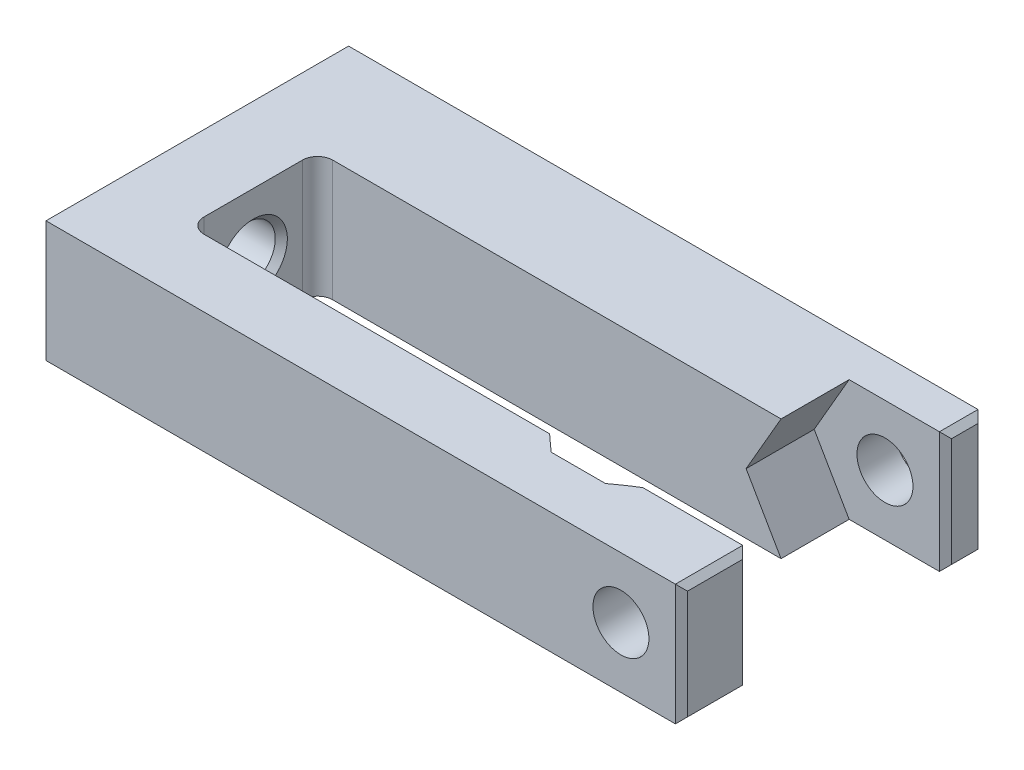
ISO-10303-21;
HEADER;
FILE_DESCRIPTION(('STEP AP214'),'2;1');
FILE_NAME('part.step','',(''),(''),'','','');
FILE_SCHEMA(('AUTOMOTIVE_DESIGN { 1 0 10303 214 1 1 1 1 }'));
ENDSEC;
DATA;
#1=APPLICATION_CONTEXT('core data for automotive mechanical design processes');
#2=APPLICATION_PROTOCOL_DEFINITION('international standard','automotive_design',2000,#1);
#3=PRODUCT_CONTEXT('',#1,'mechanical');
#4=PRODUCT('Part','Part','',(#3));
#5=PRODUCT_RELATED_PRODUCT_CATEGORY('part','',(#4));
#6=PRODUCT_DEFINITION_FORMATION('','',#4);
#7=PRODUCT_DEFINITION_CONTEXT('part definition',#1,'design');
#8=PRODUCT_DEFINITION('design','',#6,#7);
#9=PRODUCT_DEFINITION_SHAPE('','',#8);
#10=(LENGTH_UNIT() NAMED_UNIT(*) SI_UNIT(.MILLI.,.METRE.));
#11=(NAMED_UNIT(*) PLANE_ANGLE_UNIT() SI_UNIT($,.RADIAN.));
#12=(NAMED_UNIT(*) SI_UNIT($,.STERADIAN.) SOLID_ANGLE_UNIT());
#13=UNCERTAINTY_MEASURE_WITH_UNIT(LENGTH_MEASURE(1.E-05),#10,'distance_accuracy_value','');
#14=(GEOMETRIC_REPRESENTATION_CONTEXT(3) GLOBAL_UNCERTAINTY_ASSIGNED_CONTEXT((#13)) GLOBAL_UNIT_ASSIGNED_CONTEXT((#10,
#11,#12)) REPRESENTATION_CONTEXT('',''));
#15=CARTESIAN_POINT('',(0.,0.,0.));
#16=DIRECTION('',(0.,0.,1.));
#17=DIRECTION('',(1.,0.,0.));
#18=AXIS2_PLACEMENT_3D('',#15,#16,#17);
#19=CARTESIAN_POINT('',(42.,8.,-12.95));
#20=DIRECTION('',(-1.,0.,0.));
#21=DIRECTION('',(0.,0.,1.));
#22=AXIS2_PLACEMENT_3D('',#19,#20,#21);
#23=PLANE('',#22);
#24=DIRECTION('',(0.,1.,0.));
#25=VECTOR('',#24,1.);
#26=CARTESIAN_POINT('',(42.,8.,-19.6));
#27=LINE('',#26,#25);
#28=CARTESIAN_POINT('',(42.,0.399999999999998,-19.6));
#29=VERTEX_POINT('',#28);
#30=CARTESIAN_POINT('',(42.,7.6,-19.6));
#31=VERTEX_POINT('',#30);
#32=EDGE_CURVE('E490',#29,#31,#27,.T.);
#33=ORIENTED_EDGE('',*,*,#32,.T.);
#34=DIRECTION('',(0.,0.,1.));
#35=VECTOR('',#34,1.);
#36=CARTESIAN_POINT('',(42.,7.6,-17.45));
#37=LINE('',#36,#35);
#38=CARTESIAN_POINT('',(42.,7.6,-17.85));
#39=VERTEX_POINT('',#38);
#40=EDGE_CURVE('E492',#31,#39,#37,.T.);
#41=ORIENTED_EDGE('',*,*,#40,.T.);
#42=DIRECTION('',(0.,-1.,0.));
#43=VECTOR('',#42,1.);
#44=CARTESIAN_POINT('',(42.,0.,-17.85));
#45=LINE('',#44,#43);
#46=CARTESIAN_POINT('',(42.,0.399999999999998,-17.85));
#47=VERTEX_POINT('',#46);
#48=EDGE_CURVE('E486',#39,#47,#45,.T.);
#49=ORIENTED_EDGE('',*,*,#48,.T.);
#50=DIRECTION('',(0.,0.,-1.));
#51=VECTOR('',#50,1.);
#52=CARTESIAN_POINT('',(42.,0.399999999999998,-12.95));
#53=LINE('',#52,#51);
#54=EDGE_CURVE('E488',#47,#29,#53,.T.);
#55=ORIENTED_EDGE('',*,*,#54,.T.);
#56=EDGE_LOOP('',(#33,#41,#49,#55));
#57=FACE_BOUND('',#56,.T.);
#58=ADVANCED_FACE('F33',(#57),#23,.F.);
#59=CARTESIAN_POINT('',(38.,4.,-20.));
#60=DIRECTION('',(0.,0.,1.));
#61=DIRECTION('',(1.,0.,0.));
#62=AXIS2_PLACEMENT_3D('',#59,#60,#61);
#63=CYLINDRICAL_SURFACE('',#62,1.85);
#64=CARTESIAN_POINT('',(38.,4.,-20.));
#65=DIRECTION('',(0.,0.,1.));
#66=DIRECTION('',(1.,0.,0.));
#67=AXIS2_PLACEMENT_3D('',#64,#65,#66);
#68=CIRCLE('',#67,1.85);
#69=CARTESIAN_POINT('',(39.85,4.,-20.));
#70=VERTEX_POINT('',#69);
#71=EDGE_CURVE('E225',#70,#70,#68,.T.);
#72=ORIENTED_EDGE('',*,*,#71,.F.);
#73=EDGE_LOOP('',(#72));
#74=FACE_BOUND('',#73,.T.);
#75=CARTESIAN_POINT('',(38.,4.,-17.45));
#76=DIRECTION('',(0.,0.,1.));
#77=DIRECTION('',(1.,0.,0.));
#78=AXIS2_PLACEMENT_3D('',#75,#76,#77);
#79=CIRCLE('',#78,1.85);
#80=CARTESIAN_POINT('',(39.85,4.,-17.45));
#81=VERTEX_POINT('',#80);
#82=EDGE_CURVE('E187',#81,#81,#79,.F.);
#83=ORIENTED_EDGE('',*,*,#82,.F.);
#84=EDGE_LOOP('',(#83));
#85=FACE_BOUND('',#84,.T.);
#86=ADVANCED_FACE('F348',(#74,#85),#63,.F.);
#87=CARTESIAN_POINT('',(42.,8.,-4.45));
#88=DIRECTION('',(0.,0.,1.));
#89=DIRECTION('',(1.,0.,0.));
#90=AXIS2_PLACEMENT_3D('',#87,#88,#89);
#91=PLANE('',#90);
#92=DIRECTION('',(-1.,0.,0.));
#93=VECTOR('',#92,1.);
#94=CARTESIAN_POINT('',(42.,8.,-4.45));
#95=LINE('',#94,#93);
#96=CARTESIAN_POINT('',(28.8348486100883,8.,-4.45));
#97=VERTEX_POINT('',#96);
#98=CARTESIAN_POINT('',(6.,8.,-4.45));
#99=VERTEX_POINT('',#98);
#100=EDGE_CURVE('E241',#97,#99,#95,.T.);
#101=ORIENTED_EDGE('',*,*,#100,.F.);
#102=CARTESIAN_POINT('',(38.,4.,-4.45));
#103=DIRECTION('',(0.,0.,1.));
#104=DIRECTION('',(1.,0.,0.));
#105=AXIS2_PLACEMENT_3D('',#102,#103,#104);
#106=CIRCLE('',#105,10.);
#107=CARTESIAN_POINT('',(28.8348486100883,0.,-4.45));
#108=VERTEX_POINT('',#107);
#109=EDGE_CURVE('E307',#97,#108,#106,.T.);
#110=ORIENTED_EDGE('',*,*,#109,.T.);
#111=DIRECTION('',(-1.,0.,0.));
#112=VECTOR('',#111,1.);
#113=CARTESIAN_POINT('',(42.,0.,-4.45));
#114=LINE('',#113,#112);
#115=CARTESIAN_POINT('',(6.,0.,-4.45));
#116=VERTEX_POINT('',#115);
#117=EDGE_CURVE('E256',#108,#116,#114,.T.);
#118=ORIENTED_EDGE('',*,*,#117,.T.);
#119=DIRECTION('',(0.,-1.,0.));
#120=VECTOR('',#119,1.);
#121=CARTESIAN_POINT('',(6.,8.,-4.45));
#122=LINE('',#121,#120);
#123=EDGE_CURVE('E276',#116,#99,#122,.F.);
#124=ORIENTED_EDGE('',*,*,#123,.T.);
#125=EDGE_LOOP('',(#101,#110,#118,#124));
#126=FACE_BOUND('',#125,.T.);
#127=ADVANCED_FACE('F362',(#126),#91,.F.);
#128=CARTESIAN_POINT('',(0.,8.,-20.));
#129=DIRECTION('',(1.,0.,0.));
#130=DIRECTION('',(0.,0.,-1.));
#131=AXIS2_PLACEMENT_3D('',#128,#129,#130);
#132=PLANE('',#131);
#133=CARTESIAN_POINT('',(0.,3.99999999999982,-8.7));
#134=DIRECTION('',(-1.,0.,0.));
#135=DIRECTION('',(0.,0.,1.));
#136=AXIS2_PLACEMENT_3D('',#133,#134,#135);
#137=CIRCLE('',#136,1.85);
#138=CARTESIAN_POINT('',(0.,3.99999999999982,-6.85));
#139=VERTEX_POINT('',#138);
#140=EDGE_CURVE('E219',#139,#139,#137,.T.);
#141=ORIENTED_EDGE('',*,*,#140,.F.);
#142=EDGE_LOOP('',(#141));
#143=FACE_BOUND('',#142,.T.);
#144=DIRECTION('',(0.,0.,1.));
#145=VECTOR('',#144,1.);
#146=CARTESIAN_POINT('',(0.,0.,-20.));
#147=LINE('',#146,#145);
#148=CARTESIAN_POINT('',(0.,0.,-20.));
#149=VERTEX_POINT('',#148);
#150=CARTESIAN_POINT('',(0.,0.,0.));
#151=VERTEX_POINT('',#150);
#152=EDGE_CURVE('E233',#149,#151,#147,.T.);
#153=ORIENTED_EDGE('',*,*,#152,.T.);
#154=DIRECTION('',(0.,-1.,0.));
#155=VECTOR('',#154,1.);
#156=CARTESIAN_POINT('',(0.,8.,0.));
#157=LINE('',#156,#155);
#158=CARTESIAN_POINT('',(0.,8.,0.));
#159=VERTEX_POINT('',#158);
#160=EDGE_CURVE('E268',#159,#151,#157,.T.);
#161=ORIENTED_EDGE('',*,*,#160,.F.);
#162=DIRECTION('',(0.,0.,1.));
#163=VECTOR('',#162,1.);
#164=CARTESIAN_POINT('',(0.,8.,-20.));
#165=LINE('',#164,#163);
#166=CARTESIAN_POINT('',(0.,8.,-20.));
#167=VERTEX_POINT('',#166);
#168=EDGE_CURVE('E234',#167,#159,#165,.T.);
#169=ORIENTED_EDGE('',*,*,#168,.F.);
#170=DIRECTION('',(0.,-1.,0.));
#171=VECTOR('',#170,1.);
#172=CARTESIAN_POINT('',(0.,8.,-20.));
#173=LINE('',#172,#171);
#174=EDGE_CURVE('E250',#167,#149,#173,.T.);
#175=ORIENTED_EDGE('',*,*,#174,.T.);
#176=EDGE_LOOP('',(#153,#161,#169,#175));
#177=FACE_BOUND('',#176,.T.);
#178=ADVANCED_FACE('F369',(#143,#177),#132,.F.);
#179=CARTESIAN_POINT('',(0.,8.,0.));
#180=DIRECTION('',(0.,0.,-1.));
#181=DIRECTION('',(-1.,0.,0.));
#182=AXIS2_PLACEMENT_3D('',#179,#180,#181);
#183=PLANE('',#182);
#184=CARTESIAN_POINT('',(38.,4.,0.));
#185=DIRECTION('',(0.,0.,1.));
#186=DIRECTION('',(1.,0.,0.));
#187=AXIS2_PLACEMENT_3D('',#184,#185,#186);
#188=CIRCLE('',#187,1.85);
#189=CARTESIAN_POINT('',(39.85,4.,0.));
#190=VERTEX_POINT('',#189);
#191=EDGE_CURVE('E224',#190,#190,#188,.T.);
#192=ORIENTED_EDGE('',*,*,#191,.F.);
#193=EDGE_LOOP('',(#192));
#194=FACE_BOUND('',#193,.T.);
#195=DIRECTION('',(1.,0.,0.));
#196=VECTOR('',#195,1.);
#197=CARTESIAN_POINT('',(0.,0.,0.));
#198=LINE('',#197,#196);
#199=CARTESIAN_POINT('',(41.6,0.,0.));
#200=VERTEX_POINT('',#199);
#201=EDGE_CURVE('E253',#151,#200,#198,.T.);
#202=ORIENTED_EDGE('',*,*,#201,.T.);
#203=DIRECTION('',(0.,1.,0.));
#204=VECTOR('',#203,1.);
#205=CARTESIAN_POINT('',(41.6,8.,0.));
#206=LINE('',#205,#204);
#207=CARTESIAN_POINT('',(41.6,8.,0.));
#208=VERTEX_POINT('',#207);
#209=EDGE_CURVE('E471',#200,#208,#206,.T.);
#210=ORIENTED_EDGE('',*,*,#209,.T.);
#211=DIRECTION('',(1.,0.,0.));
#212=VECTOR('',#211,1.);
#213=CARTESIAN_POINT('',(0.,8.,0.));
#214=LINE('',#213,#212);
#215=EDGE_CURVE('E237',#159,#208,#214,.T.);
#216=ORIENTED_EDGE('',*,*,#215,.F.);
#217=ORIENTED_EDGE('',*,*,#160,.T.);
#218=EDGE_LOOP('',(#202,#210,#216,#217));
#219=FACE_BOUND('',#218,.T.);
#220=ADVANCED_FACE('F365',(#194,#219),#183,.F.);
#221=CARTESIAN_POINT('',(42.,8.,0.));
#222=DIRECTION('',(-1.,0.,0.));
#223=DIRECTION('',(0.,0.,1.));
#224=AXIS2_PLACEMENT_3D('',#221,#222,#223);
#225=PLANE('',#224);
#226=DIRECTION('',(0.,0.,1.));
#227=VECTOR('',#226,1.);
#228=CARTESIAN_POINT('',(42.,7.6,0.));
#229=LINE('',#228,#227);
#230=CARTESIAN_POINT('',(42.,7.6,-4.05));
#231=VERTEX_POINT('',#230);
#232=CARTESIAN_POINT('',(42.,7.6,-0.399999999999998));
#233=VERTEX_POINT('',#232);
#234=EDGE_CURVE('E464',#231,#233,#229,.T.);
#235=ORIENTED_EDGE('',*,*,#234,.T.);
#236=DIRECTION('',(0.,-1.,0.));
#237=VECTOR('',#236,1.);
#238=CARTESIAN_POINT('',(42.,8.,-0.399999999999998));
#239=LINE('',#238,#237);
#240=CARTESIAN_POINT('',(42.,0.399999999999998,-0.399999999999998));
#241=VERTEX_POINT('',#240);
#242=EDGE_CURVE('E468',#233,#241,#239,.T.);
#243=ORIENTED_EDGE('',*,*,#242,.T.);
#244=DIRECTION('',(0.,0.,-1.));
#245=VECTOR('',#244,1.);
#246=CARTESIAN_POINT('',(42.,0.399999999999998,0.));
#247=LINE('',#246,#245);
#248=CARTESIAN_POINT('',(42.,0.399999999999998,-4.05));
#249=VERTEX_POINT('',#248);
#250=EDGE_CURVE('E473',#241,#249,#247,.T.);
#251=ORIENTED_EDGE('',*,*,#250,.T.);
#252=DIRECTION('',(0.,1.,0.));
#253=VECTOR('',#252,1.);
#254=CARTESIAN_POINT('',(42.,8.,-4.05));
#255=LINE('',#254,#253);
#256=EDGE_CURVE('E469',#249,#231,#255,.T.);
#257=ORIENTED_EDGE('',*,*,#256,.T.);
#258=EDGE_LOOP('',(#235,#243,#251,#257));
#259=FACE_BOUND('',#258,.T.);
#260=ADVANCED_FACE('F360',(#259),#225,.F.);
#261=CARTESIAN_POINT('',(38.,4.,-4.45));
#262=DIRECTION('',(0.,0.,1.));
#263=DIRECTION('',(1.,0.,0.));
#264=AXIS2_PLACEMENT_3D('',#261,#262,#263);
#265=CIRCLE('',#264,1.85);
#266=CARTESIAN_POINT('',(39.85,4.,-4.45));
#267=VERTEX_POINT('',#266);
#268=EDGE_CURVE('E228',#267,#267,#265,.T.);
#269=ORIENTED_EDGE('',*,*,#268,.T.);
#270=EDGE_LOOP('',(#269));
#271=FACE_BOUND('',#270,.T.);
#272=CARTESIAN_POINT('',(41.6,8.,-4.45));
#273=VERTEX_POINT('',#272);
#274=CARTESIAN_POINT('',(35.,8.,-4.45));
#275=VERTEX_POINT('',#274);
#276=EDGE_CURVE('E242',#273,#275,#95,.T.);
#277=ORIENTED_EDGE('',*,*,#276,.F.);
#278=DIRECTION('',(0.,-1.,0.));
#279=VECTOR('',#278,1.);
#280=CARTESIAN_POINT('',(41.6,8.,-4.45));
#281=LINE('',#280,#279);
#282=CARTESIAN_POINT('',(41.6,0.,-4.45));
#283=VERTEX_POINT('',#282);
#284=EDGE_CURVE('E445',#273,#283,#281,.T.);
#285=ORIENTED_EDGE('',*,*,#284,.T.);
#286=CARTESIAN_POINT('',(35.,0.,-4.45));
#287=VERTEX_POINT('',#286);
#288=EDGE_CURVE('E257',#283,#287,#114,.T.);
#289=ORIENTED_EDGE('',*,*,#288,.T.);
#290=CARTESIAN_POINT('',(38.,4.,-4.45));
#291=DIRECTION('',(0.,0.,1.));
#292=DIRECTION('',(1.,0.,0.));
#293=AXIS2_PLACEMENT_3D('',#290,#291,#292);
#294=CIRCLE('',#293,5.);
#295=EDGE_CURVE('E213',#275,#287,#294,.T.);
#296=ORIENTED_EDGE('',*,*,#295,.F.);
#297=EDGE_LOOP('',(#277,#285,#289,#296));
#298=FACE_BOUND('',#297,.T.);
#299=ADVANCED_FACE('F356',(#271,#298),#91,.F.);
#300=CARTESIAN_POINT('',(5.,8.,-4.45));
#301=DIRECTION('',(-1.,0.,0.));
#302=DIRECTION('',(0.,0.,1.));
#303=AXIS2_PLACEMENT_3D('',#300,#301,#302);
#304=PLANE('',#303);
#305=CARTESIAN_POINT('',(5.,3.99999999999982,-8.7));
#306=DIRECTION('',(-1.,0.,0.));
#307=DIRECTION('',(0.,0.,1.));
#308=AXIS2_PLACEMENT_3D('',#305,#306,#307);
#309=CIRCLE('',#308,2.24999999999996);
#310=CARTESIAN_POINT('',(5.,3.99999999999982,-6.45000000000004));
#311=VERTEX_POINT('',#310);
#312=EDGE_CURVE('E291',#311,#311,#309,.T.);
#313=ORIENTED_EDGE('',*,*,#312,.T.);
#314=EDGE_LOOP('',(#313));
#315=FACE_BOUND('',#314,.T.);
#316=DIRECTION('',(0.,0.,-1.));
#317=VECTOR('',#316,1.);
#318=CARTESIAN_POINT('',(5.,8.,-4.45));
#319=LINE('',#318,#317);
#320=CARTESIAN_POINT('',(5.,8.,-5.45));
#321=VERTEX_POINT('',#320);
#322=CARTESIAN_POINT('',(5.,8.,-11.95));
#323=VERTEX_POINT('',#322);
#324=EDGE_CURVE('E244',#321,#323,#319,.T.);
#325=ORIENTED_EDGE('',*,*,#324,.F.);
#326=DIRECTION('',(0.,-1.,0.));
#327=VECTOR('',#326,1.);
#328=CARTESIAN_POINT('',(5.,0.,-5.45));
#329=LINE('',#328,#327);
#330=CARTESIAN_POINT('',(5.,0.,-5.45));
#331=VERTEX_POINT('',#330);
#332=EDGE_CURVE('E273',#321,#331,#329,.T.);
#333=ORIENTED_EDGE('',*,*,#332,.T.);
#334=DIRECTION('',(0.,0.,-1.));
#335=VECTOR('',#334,1.);
#336=CARTESIAN_POINT('',(5.,0.,-4.45));
#337=LINE('',#336,#335);
#338=CARTESIAN_POINT('',(5.,0.,-11.95));
#339=VERTEX_POINT('',#338);
#340=EDGE_CURVE('E259',#331,#339,#337,.T.);
#341=ORIENTED_EDGE('',*,*,#340,.T.);
#342=DIRECTION('',(0.,-1.,0.));
#343=VECTOR('',#342,1.);
#344=CARTESIAN_POINT('',(5.,8.,-11.95));
#345=LINE('',#344,#343);
#346=EDGE_CURVE('E271',#339,#323,#345,.F.);
#347=ORIENTED_EDGE('',*,*,#346,.T.);
#348=EDGE_LOOP('',(#325,#333,#341,#347));
#349=FACE_BOUND('',#348,.T.);
#350=ADVANCED_FACE('F352',(#315,#349),#304,.F.);
#351=CARTESIAN_POINT('',(5.,8.,-12.95));
#352=DIRECTION('',(0.,0.,-1.));
#353=DIRECTION('',(-1.,0.,0.));
#354=AXIS2_PLACEMENT_3D('',#351,#352,#353);
#355=PLANE('',#354);
#356=DIRECTION('',(1.,0.,0.));
#357=VECTOR('',#356,1.);
#358=CARTESIAN_POINT('',(5.,0.,-12.95));
#359=LINE('',#358,#357);
#360=CARTESIAN_POINT('',(6.,0.,-12.95));
#361=VERTEX_POINT('',#360);
#362=CARTESIAN_POINT('',(35.6328638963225,0.,-12.95));
#363=VERTEX_POINT('',#362);
#364=EDGE_CURVE('E262',#361,#363,#359,.T.);
#365=ORIENTED_EDGE('',*,*,#364,.T.);
#366=DIRECTION('',(0.500000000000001,-0.866025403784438,0.));
#367=VECTOR('',#366,1.);
#368=CARTESIAN_POINT('',(26.7246479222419,15.4294826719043,-12.95));
#369=LINE('',#368,#367);
#370=CARTESIAN_POINT('',(33.323462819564,4.00000000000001,-12.95));
#371=VERTEX_POINT('',#370);
#372=EDGE_CURVE('E408',#371,#363,#369,.T.);
#373=ORIENTED_EDGE('',*,*,#372,.F.);
#374=DIRECTION('',(-0.5,-0.866025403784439,0.));
#375=VECTOR('',#374,1.);
#376=CARTESIAN_POINT('',(23.2605463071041,-13.4294826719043,-12.95));
#377=LINE('',#376,#375);
#378=CARTESIAN_POINT('',(35.6328638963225,8.,-12.95));
#379=VERTEX_POINT('',#378);
#380=EDGE_CURVE('E407',#379,#371,#377,.T.);
#381=ORIENTED_EDGE('',*,*,#380,.F.);
#382=DIRECTION('',(1.,0.,0.));
#383=VECTOR('',#382,1.);
#384=CARTESIAN_POINT('',(5.,8.,-12.95));
#385=LINE('',#384,#383);
#386=CARTESIAN_POINT('',(6.,8.,-12.95));
#387=VERTEX_POINT('',#386);
#388=EDGE_CURVE('E201',#387,#379,#385,.T.);
#389=ORIENTED_EDGE('',*,*,#388,.F.);
#390=DIRECTION('',(0.,-1.,0.));
#391=VECTOR('',#390,1.);
#392=CARTESIAN_POINT('',(6.,0.,-12.95));
#393=LINE('',#392,#391);
#394=EDGE_CURVE('E279',#387,#361,#393,.T.);
#395=ORIENTED_EDGE('',*,*,#394,.T.);
#396=EDGE_LOOP('',(#365,#373,#381,#389,#395));
#397=FACE_BOUND('',#396,.T.);
#398=ADVANCED_FACE('F344',(#397),#355,.F.);
#399=CARTESIAN_POINT('',(42.,8.,-20.));
#400=DIRECTION('',(0.,0.,1.));
#401=DIRECTION('',(1.,0.,0.));
#402=AXIS2_PLACEMENT_3D('',#399,#400,#401);
#403=PLANE('',#402);
#404=ORIENTED_EDGE('',*,*,#71,.T.);
#405=EDGE_LOOP('',(#404));
#406=FACE_BOUND('',#405,.T.);
#407=DIRECTION('',(-1.,0.,0.));
#408=VECTOR('',#407,1.);
#409=CARTESIAN_POINT('',(42.,8.,-20.));
#410=LINE('',#409,#408);
#411=CARTESIAN_POINT('',(41.6,8.,-20.));
#412=VERTEX_POINT('',#411);
#413=EDGE_CURVE('E248',#412,#167,#410,.T.);
#414=ORIENTED_EDGE('',*,*,#413,.F.);
#415=DIRECTION('',(0.,-1.,0.));
#416=VECTOR('',#415,1.);
#417=CARTESIAN_POINT('',(41.6,8.,-20.));
#418=LINE('',#417,#416);
#419=CARTESIAN_POINT('',(41.6,0.,-20.));
#420=VERTEX_POINT('',#419);
#421=EDGE_CURVE('E57',#412,#420,#418,.T.);
#422=ORIENTED_EDGE('',*,*,#421,.T.);
#423=DIRECTION('',(-1.,0.,0.));
#424=VECTOR('',#423,1.);
#425=CARTESIAN_POINT('',(42.,0.,-20.));
#426=LINE('',#425,#424);
#427=EDGE_CURVE('E238',#420,#149,#426,.T.);
#428=ORIENTED_EDGE('',*,*,#427,.T.);
#429=ORIENTED_EDGE('',*,*,#174,.F.);
#430=EDGE_LOOP('',(#414,#422,#428,#429));
#431=FACE_BOUND('',#430,.T.);
#432=ADVANCED_FACE('F340',(#406,#431),#403,.F.);
#433=CARTESIAN_POINT('',(0.,8.,0.));
#434=DIRECTION('',(0.,1.,0.));
#435=DIRECTION('',(0.,0.,1.));
#436=AXIS2_PLACEMENT_3D('',#433,#434,#435);
#437=PLANE('',#436);
#438=DIRECTION('',(-1.,0.,0.));
#439=VECTOR('',#438,1.);
#440=CARTESIAN_POINT('',(0.,8.,-17.45));
#441=LINE('',#440,#439);
#442=CARTESIAN_POINT('',(41.6,8.,-17.45));
#443=VERTEX_POINT('',#442);
#444=CARTESIAN_POINT('',(35.6328638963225,8.,-17.45));
#445=VERTEX_POINT('',#444);
#446=EDGE_CURVE('E178',#443,#445,#441,.T.);
#447=ORIENTED_EDGE('',*,*,#446,.F.);
#448=DIRECTION('',(0.,0.,-1.));
#449=VECTOR('',#448,1.);
#450=CARTESIAN_POINT('',(41.6,8.,-20.));
#451=LINE('',#450,#449);
#452=EDGE_CURVE('E480',#443,#412,#451,.T.);
#453=ORIENTED_EDGE('',*,*,#452,.T.);
#454=ORIENTED_EDGE('',*,*,#413,.T.);
#455=ORIENTED_EDGE('',*,*,#168,.T.);
#456=ORIENTED_EDGE('',*,*,#215,.T.);
#457=DIRECTION('',(0.,0.,-1.));
#458=VECTOR('',#457,1.);
#459=CARTESIAN_POINT('',(41.6,8.,-4.45));
#460=LINE('',#459,#458);
#461=EDGE_CURVE('E457',#208,#273,#460,.T.);
#462=ORIENTED_EDGE('',*,*,#461,.T.);
#463=ORIENTED_EDGE('',*,*,#276,.T.);
#464=CARTESIAN_POINT('',(35.,8.,-4.44999999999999));
#465=CARTESIAN_POINT('',(34.8727311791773,8.,-4.37359864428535));
#466=CARTESIAN_POINT('',(34.7468222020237,8.,-4.29498407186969));
#467=CARTESIAN_POINT('',(34.4974561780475,8.,-4.13411459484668));
#468=CARTESIAN_POINT('',(34.3739976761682,8.,-4.05186195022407));
#469=CARTESIAN_POINT('',(34.1291302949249,8.,-3.88442106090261));
#470=CARTESIAN_POINT('',(34.0077210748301,8.,-3.79923331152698));
#471=CARTESIAN_POINT('',(33.7665819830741,8.,-3.62635645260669));
#472=CARTESIAN_POINT('',(33.6468531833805,8.,-3.53866584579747));
#473=CARTESIAN_POINT('',(33.5278640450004,8.,-3.45));
#474=B_SPLINE_CURVE_WITH_KNOTS('',3,(#464,#465,#466,#467,#468,#469,#470,#471,#472,#473),
.UNSPECIFIED.,.F.,.F.,(4,2,2,2,4),(0.,0.445259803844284,0.890246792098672,1.33515904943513,
1.78034328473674),.UNSPECIFIED.);
#475=CARTESIAN_POINT('',(33.5278640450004,8.,-3.45));
#476=VERTEX_POINT('',#475);
#477=EDGE_CURVE('E530',#275,#476,#474,.T.);
#478=ORIENTED_EDGE('',*,*,#477,.T.);
#479=DIRECTION('',(1.,0.,0.));
#480=VECTOR('',#479,1.);
#481=CARTESIAN_POINT('',(35.,8.,-3.45));
#482=LINE('',#481,#480);
#483=CARTESIAN_POINT('',(29.9377422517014,8.,-3.45));
#484=VERTEX_POINT('',#483);
#485=EDGE_CURVE('E216',#484,#476,#482,.T.);
#486=ORIENTED_EDGE('',*,*,#485,.F.);
#487=CARTESIAN_POINT('',(29.9377422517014,8.,-3.45));
#488=CARTESIAN_POINT('',(29.8453344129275,8.,-3.53278046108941));
#489=CARTESIAN_POINT('',(29.7530654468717,8.,-3.61571577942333));
#490=CARTESIAN_POINT('',(29.5687846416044,8.,-3.78187012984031));
#491=CARTESIAN_POINT('',(29.4767728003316,8.,-3.86508915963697));
#492=CARTESIAN_POINT('',(29.2929842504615,8.,-4.03178616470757));
#493=CARTESIAN_POINT('',(29.2012075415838,8.,-4.11526413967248));
#494=CARTESIAN_POINT('',(29.0178702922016,8.,-4.28245862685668));
#495=CARTESIAN_POINT('',(28.9263097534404,8.,-4.36617514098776));
#496=CARTESIAN_POINT('',(28.8348486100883,8.,-4.45));
#497=B_SPLINE_CURVE_WITH_KNOTS('',3,(#487,#488,#489,#490,#491,#492,#493,#494,#495,#496),
.UNSPECIFIED.,.F.,.F.,(4,2,2,2,4),(0.,0.372190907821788,0.744378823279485,1.11656629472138,
1.48875675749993),.UNSPECIFIED.);
#498=EDGE_CURVE('E300',#484,#97,#497,.T.);
#499=ORIENTED_EDGE('',*,*,#498,.T.);
#500=ORIENTED_EDGE('',*,*,#100,.T.);
#501=CARTESIAN_POINT('',(6.,8.,-5.45));
#502=DIRECTION('',(0.,1.,0.));
#503=DIRECTION('',(0.,0.,1.));
#504=AXIS2_PLACEMENT_3D('',#501,#502,#503);
#505=CIRCLE('',#504,1.);
#506=EDGE_CURVE('E285',#99,#321,#505,.F.);
#507=ORIENTED_EDGE('',*,*,#506,.T.);
#508=ORIENTED_EDGE('',*,*,#324,.T.);
#509=CARTESIAN_POINT('',(6.,8.,-11.95));
#510=DIRECTION('',(0.,1.,0.));
#511=DIRECTION('',(0.,0.,1.));
#512=AXIS2_PLACEMENT_3D('',#509,#510,#511);
#513=CIRCLE('',#512,1.);
#514=EDGE_CURVE('E289',#323,#387,#513,.F.);
#515=ORIENTED_EDGE('',*,*,#514,.T.);
#516=ORIENTED_EDGE('',*,*,#388,.T.);
#517=DIRECTION('',(0.,0.,1.));
#518=VECTOR('',#517,1.);
#519=CARTESIAN_POINT('',(35.6328638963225,8.,-17.45));
#520=LINE('',#519,#518);
#521=EDGE_CURVE('E192',#445,#379,#520,.T.);
#522=ORIENTED_EDGE('',*,*,#521,.F.);
#523=EDGE_LOOP('',(#447,#453,#454,#455,#456,#462,#463,#478,#486,#499,#500,#507,#508,#515,#516,#522));
#524=FACE_BOUND('',#523,.T.);
#525=ADVANCED_FACE('F199',(#524),#437,.T.);
#526=CARTESIAN_POINT('',(0.,0.,0.));
#527=DIRECTION('',(0.,1.,0.));
#528=DIRECTION('',(0.,0.,1.));
#529=AXIS2_PLACEMENT_3D('',#526,#527,#528);
#530=PLANE('',#529);
#531=ORIENTED_EDGE('',*,*,#427,.F.);
#532=DIRECTION('',(0.,0.,1.));
#533=VECTOR('',#532,1.);
#534=CARTESIAN_POINT('',(41.6,0.,0.));
#535=LINE('',#534,#533);
#536=CARTESIAN_POINT('',(41.6,0.,-17.45));
#537=VERTEX_POINT('',#536);
#538=EDGE_CURVE('E42',#420,#537,#535,.T.);
#539=ORIENTED_EDGE('',*,*,#538,.T.);
#540=DIRECTION('',(1.,0.,0.));
#541=VECTOR('',#540,1.);
#542=CARTESIAN_POINT('',(0.,0.,-17.45));
#543=LINE('',#542,#541);
#544=CARTESIAN_POINT('',(35.6328638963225,0.,-17.45));
#545=VERTEX_POINT('',#544);
#546=EDGE_CURVE('E202',#545,#537,#543,.T.);
#547=ORIENTED_EDGE('',*,*,#546,.F.);
#548=DIRECTION('',(0.,0.,1.));
#549=VECTOR('',#548,1.);
#550=CARTESIAN_POINT('',(35.6328638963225,0.,-17.45));
#551=LINE('',#550,#549);
#552=EDGE_CURVE('E204',#545,#363,#551,.T.);
#553=ORIENTED_EDGE('',*,*,#552,.T.);
#554=ORIENTED_EDGE('',*,*,#364,.F.);
#555=CARTESIAN_POINT('',(6.,0.,-11.95));
#556=DIRECTION('',(0.,1.,0.));
#557=DIRECTION('',(0.,0.,1.));
#558=AXIS2_PLACEMENT_3D('',#555,#556,#557);
#559=CIRCLE('',#558,1.);
#560=EDGE_CURVE('E287',#361,#339,#559,.T.);
#561=ORIENTED_EDGE('',*,*,#560,.T.);
#562=ORIENTED_EDGE('',*,*,#340,.F.);
#563=CARTESIAN_POINT('',(6.,0.,-5.45));
#564=DIRECTION('',(0.,1.,0.));
#565=DIRECTION('',(0.,0.,1.));
#566=AXIS2_PLACEMENT_3D('',#563,#564,#565);
#567=CIRCLE('',#566,1.);
#568=EDGE_CURVE('E282',#331,#116,#567,.T.);
#569=ORIENTED_EDGE('',*,*,#568,.T.);
#570=ORIENTED_EDGE('',*,*,#117,.F.);
#571=CARTESIAN_POINT('',(28.8348486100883,0.,-4.45));
#572=CARTESIAN_POINT('',(28.9263097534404,0.,-4.36617514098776));
#573=CARTESIAN_POINT('',(29.0178702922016,0.,-4.28245862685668));
#574=CARTESIAN_POINT('',(29.2012075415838,0.,-4.11526413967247));
#575=CARTESIAN_POINT('',(29.2929842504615,0.,-4.03178616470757));
#576=CARTESIAN_POINT('',(29.4767728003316,0.,-3.86508915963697));
#577=CARTESIAN_POINT('',(29.5687846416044,0.,-3.7818701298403));
#578=CARTESIAN_POINT('',(29.7530654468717,0.,-3.61571577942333));
#579=CARTESIAN_POINT('',(29.8453344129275,0.,-3.53278046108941));
#580=CARTESIAN_POINT('',(29.9377422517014,0.,-3.45));
#581=B_SPLINE_CURVE_WITH_KNOTS('',3,(#571,#572,#573,#574,#575,#576,#577,#578,#579,#580),
.UNSPECIFIED.,.F.,.F.,(4,2,2,2,4),(0.,0.372190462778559,0.74437793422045,1.11656584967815,
1.48875675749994),.UNSPECIFIED.);
#582=CARTESIAN_POINT('',(29.9377422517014,0.,-3.45));
#583=VERTEX_POINT('',#582);
#584=EDGE_CURVE('E325',#108,#583,#581,.T.);
#585=ORIENTED_EDGE('',*,*,#584,.T.);
#586=DIRECTION('',(-1.,0.,0.));
#587=VECTOR('',#586,1.);
#588=CARTESIAN_POINT('',(29.9377422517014,0.,-3.45));
#589=LINE('',#588,#587);
#590=CARTESIAN_POINT('',(33.5278640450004,0.,-3.45));
#591=VERTEX_POINT('',#590);
#592=EDGE_CURVE('E209',#591,#583,#589,.T.);
#593=ORIENTED_EDGE('',*,*,#592,.F.);
#594=CARTESIAN_POINT('',(33.5278640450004,0.,-3.45));
#595=CARTESIAN_POINT('',(33.6468531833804,0.,-3.53866584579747));
#596=CARTESIAN_POINT('',(33.7665819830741,0.,-3.62635645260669));
#597=CARTESIAN_POINT('',(34.0077210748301,0.,-3.79923331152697));
#598=CARTESIAN_POINT('',(34.1291302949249,0.,-3.88442106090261));
#599=CARTESIAN_POINT('',(34.3739976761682,0.,-4.05186195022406));
#600=CARTESIAN_POINT('',(34.4974561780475,0.,-4.13411459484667));
#601=CARTESIAN_POINT('',(34.7468222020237,0.,-4.29498407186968));
#602=CARTESIAN_POINT('',(34.8727311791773,0.,-4.37359864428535));
#603=CARTESIAN_POINT('',(35.,0.,-4.44999999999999));
#604=B_SPLINE_CURVE_WITH_KNOTS('',3,(#594,#595,#596,#597,#598,#599,#600,#601,#602,#603),
.UNSPECIFIED.,.F.,.F.,(4,2,2,2,4),(0.,0.445184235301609,0.890096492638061,1.33508348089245,
1.78034328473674),.UNSPECIFIED.);
#605=EDGE_CURVE('E330',#591,#287,#604,.T.);
#606=ORIENTED_EDGE('',*,*,#605,.T.);
#607=ORIENTED_EDGE('',*,*,#288,.F.);
#608=DIRECTION('',(0.,0.,1.));
#609=VECTOR('',#608,1.);
#610=CARTESIAN_POINT('',(41.6,0.,0.));
#611=LINE('',#610,#609);
#612=EDGE_CURVE('E456',#283,#200,#611,.T.);
#613=ORIENTED_EDGE('',*,*,#612,.T.);
#614=ORIENTED_EDGE('',*,*,#201,.F.);
#615=ORIENTED_EDGE('',*,*,#152,.F.);
#616=EDGE_LOOP('',(#531,#539,#547,#553,#554,#561,#562,#569,#570,#585,#593,#606,#607,#613,#614,#615));
#617=FACE_BOUND('',#616,.T.);
#618=ADVANCED_FACE('F335',(#617),#530,.F.);
#619=ORIENTED_EDGE('',*,*,#191,.T.);
#620=EDGE_LOOP('',(#619));
#621=FACE_BOUND('',#620,.T.);
#622=ORIENTED_EDGE('',*,*,#268,.F.);
#623=EDGE_LOOP('',(#622));
#624=FACE_BOUND('',#623,.T.);
#625=ADVANCED_FACE('F339',(#621,#624),#63,.F.);
#626=CARTESIAN_POINT('',(42.,3.99999999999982,-8.7));
#627=DIRECTION('',(-1.,0.,0.));
#628=DIRECTION('',(0.,0.,1.));
#629=AXIS2_PLACEMENT_3D('',#626,#627,#628);
#630=CYLINDRICAL_SURFACE('',#629,1.85);
#631=CARTESIAN_POINT('',(4.60000000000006,3.99999999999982,-8.7));
#632=DIRECTION('',(-1.,0.,0.));
#633=DIRECTION('',(0.,0.,1.));
#634=AXIS2_PLACEMENT_3D('',#631,#632,#633);
#635=CIRCLE('',#634,1.85);
#636=CARTESIAN_POINT('',(4.60000000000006,3.99999999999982,-6.85));
#637=VERTEX_POINT('',#636);
#638=EDGE_CURVE('E294',#637,#637,#635,.F.);
#639=CARTESIAN_POINT('',(4.60000000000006,3.99999999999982,-6.85));
#640=CARTESIAN_POINT('',(4.55208333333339,3.99999999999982,-6.85));
#641=CARTESIAN_POINT('',(4.50416666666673,3.99999999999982,-6.85));
#642=CARTESIAN_POINT('',(4.40833333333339,3.99999999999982,-6.85));
#643=CARTESIAN_POINT('',(4.36041666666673,3.99999999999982,-6.85));
#644=CARTESIAN_POINT('',(4.26458333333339,3.99999999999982,-6.85));
#645=CARTESIAN_POINT('',(4.21666666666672,3.99999999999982,-6.85));
#646=CARTESIAN_POINT('',(4.12083333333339,3.99999999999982,-6.85));
#647=CARTESIAN_POINT('',(4.07291666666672,3.99999999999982,-6.85));
#648=CARTESIAN_POINT('',(3.97708333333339,3.99999999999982,-6.85));
#649=CARTESIAN_POINT('',(3.92916666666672,3.99999999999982,-6.85));
#650=CARTESIAN_POINT('',(3.83333333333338,3.99999999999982,-6.85));
#651=CARTESIAN_POINT('',(3.78541666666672,3.99999999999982,-6.85));
#652=CARTESIAN_POINT('',(3.68958333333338,3.99999999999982,-6.85));
#653=CARTESIAN_POINT('',(3.64166666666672,3.99999999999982,-6.85));
#654=CARTESIAN_POINT('',(3.54583333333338,3.99999999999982,-6.85));
#655=CARTESIAN_POINT('',(3.49791666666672,3.99999999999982,-6.85));
#656=CARTESIAN_POINT('',(3.40208333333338,3.99999999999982,-6.85));
#657=CARTESIAN_POINT('',(3.35416666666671,3.99999999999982,-6.85));
#658=CARTESIAN_POINT('',(3.25833333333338,3.99999999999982,-6.85));
#659=CARTESIAN_POINT('',(3.21041666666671,3.99999999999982,-6.85));
#660=CARTESIAN_POINT('',(3.11458333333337,3.99999999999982,-6.85));
#661=CARTESIAN_POINT('',(3.06666666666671,3.99999999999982,-6.85));
#662=CARTESIAN_POINT('',(2.97083333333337,3.99999999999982,-6.85));
#663=CARTESIAN_POINT('',(2.92291666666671,3.99999999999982,-6.85));
#664=CARTESIAN_POINT('',(2.82708333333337,3.99999999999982,-6.85));
#665=CARTESIAN_POINT('',(2.77916666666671,3.99999999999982,-6.85));
#666=CARTESIAN_POINT('',(2.68333333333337,3.99999999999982,-6.85));
#667=CARTESIAN_POINT('',(2.6354166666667,3.99999999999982,-6.85));
#668=CARTESIAN_POINT('',(2.53958333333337,3.99999999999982,-6.85));
#669=CARTESIAN_POINT('',(2.4916666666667,3.99999999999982,-6.85));
#670=CARTESIAN_POINT('',(2.39583333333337,3.99999999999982,-6.85));
#671=CARTESIAN_POINT('',(2.3479166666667,3.99999999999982,-6.85));
#672=CARTESIAN_POINT('',(2.25208333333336,3.99999999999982,-6.85));
#673=CARTESIAN_POINT('',(2.20416666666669,3.99999999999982,-6.85));
#674=CARTESIAN_POINT('',(2.10833333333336,3.99999999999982,-6.85));
#675=CARTESIAN_POINT('',(2.06041666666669,3.99999999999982,-6.85));
#676=CARTESIAN_POINT('',(1.96458333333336,3.99999999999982,-6.85));
#677=CARTESIAN_POINT('',(1.91666666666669,3.99999999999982,-6.85));
#678=CARTESIAN_POINT('',(1.82083333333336,3.99999999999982,-6.85));
#679=CARTESIAN_POINT('',(1.77291666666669,3.99999999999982,-6.85));
#680=CARTESIAN_POINT('',(1.67708333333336,3.99999999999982,-6.85));
#681=CARTESIAN_POINT('',(1.62916666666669,3.99999999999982,-6.85));
#682=CARTESIAN_POINT('',(1.53333333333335,3.99999999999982,-6.85));
#683=CARTESIAN_POINT('',(1.48541666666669,3.99999999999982,-6.85));
#684=CARTESIAN_POINT('',(1.38958333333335,3.99999999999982,-6.85));
#685=CARTESIAN_POINT('',(1.34166666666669,3.99999999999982,-6.85));
#686=CARTESIAN_POINT('',(1.24583333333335,3.99999999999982,-6.85));
#687=CARTESIAN_POINT('',(1.19791666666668,3.99999999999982,-6.85));
#688=CARTESIAN_POINT('',(1.10208333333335,3.99999999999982,-6.85));
#689=CARTESIAN_POINT('',(1.05416666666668,3.99999999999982,-6.85));
#690=CARTESIAN_POINT('',(0.958333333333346,3.99999999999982,-6.85));
#691=CARTESIAN_POINT('',(0.910416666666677,3.99999999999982,-6.85));
#692=CARTESIAN_POINT('',(0.814583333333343,3.99999999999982,-6.85));
#693=CARTESIAN_POINT('',(0.766666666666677,3.99999999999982,-6.85));
#694=CARTESIAN_POINT('',(0.670833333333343,3.99999999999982,-6.85));
#695=CARTESIAN_POINT('',(0.622916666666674,3.99999999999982,-6.85));
#696=CARTESIAN_POINT('',(0.52708333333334,3.99999999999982,-6.85));
#697=CARTESIAN_POINT('',(0.479166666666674,3.99999999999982,-6.85));
#698=CARTESIAN_POINT('',(0.38333333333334,3.99999999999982,-6.85));
#699=CARTESIAN_POINT('',(0.335416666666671,3.99999999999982,-6.85));
#700=CARTESIAN_POINT('',(0.239583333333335,3.99999999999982,-6.85));
#701=CARTESIAN_POINT('',(0.191666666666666,3.99999999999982,-6.85));
#702=CARTESIAN_POINT('',(0.095833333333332,3.99999999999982,-6.85));
#703=CARTESIAN_POINT('',(0.047916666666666,3.99999999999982,-6.85));
#704=CARTESIAN_POINT('',(0.,3.99999999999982,-6.85));
#705=B_SPLINE_CURVE_WITH_KNOTS('',3,(#639,#640,#641,#642,#643,#644,#645,#646,#647,#648,#649,
#650,#651,#652,#653,#654,#655,#656,#657,#658,#659,#660,#661,#662,#663,#664,#665,#666,#667,#668,
#669,#670,#671,#672,#673,#674,#675,#676,#677,#678,#679,#680,#681,#682,#683,#684,#685,#686,#687,
#688,#689,#690,#691,#692,#693,#694,#695,#696,#697,#698,#699,#700,#701,#702,#703,#704),
.UNSPECIFIED.,.F.,.F.,(4,2,2,2,2,2,2,2,2,2,2,2,2,2,2,2,2,2,2,2,2,2,2,2,2,2,2,2,2,2,2,2,4),(0.,
0.143750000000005,0.287500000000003,0.431250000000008,0.575000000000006,0.718750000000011,
0.862500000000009,1.00625000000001,1.15000000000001,1.29375000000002,1.43750000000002,
1.58125000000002,1.72500000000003,1.86875000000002,2.01250000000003,2.15625000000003,
2.30000000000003,2.44375000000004,2.58750000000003,2.73125000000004,2.87500000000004,
3.01875000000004,3.16250000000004,3.30625000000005,3.45000000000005,3.59375000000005,
3.73750000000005,3.88125000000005,4.02500000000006,4.16875000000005,4.31250000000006,
4.45625000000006,4.60000000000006),.UNSPECIFIED.);
#706=EDGE_CURVE('BSEAM378',#637,#139,#705,.T.);
#707=ORIENTED_EDGE('',*,*,#638,.T.);
#708=ORIENTED_EDGE('',*,*,#140,.T.);
#709=ORIENTED_EDGE('',*,*,#706,.T.);
#710=ORIENTED_EDGE('',*,*,#706,.F.);
#711=EDGE_LOOP('',(#707,#709,#708,#710));
#712=FACE_BOUND('',#711,.T.);
#713=ADVANCED_FACE('F378',(#712),#630,.F.);
#714=CARTESIAN_POINT('',(6.,8.,-5.45));
#715=DIRECTION('',(0.,1.,0.));
#716=DIRECTION('',(0.,0.,1.));
#717=AXIS2_PLACEMENT_3D('',#714,#715,#716);
#718=CYLINDRICAL_SURFACE('',#717,1.);
#719=ORIENTED_EDGE('',*,*,#506,.F.);
#720=ORIENTED_EDGE('',*,*,#123,.F.);
#721=ORIENTED_EDGE('',*,*,#568,.F.);
#722=ORIENTED_EDGE('',*,*,#332,.F.);
#723=EDGE_LOOP('',(#719,#720,#721,#722));
#724=FACE_BOUND('',#723,.T.);
#725=ADVANCED_FACE('F374',(#724),#718,.F.);
#726=CARTESIAN_POINT('',(6.,8.,-11.95));
#727=DIRECTION('',(0.,1.,0.));
#728=DIRECTION('',(0.,0.,1.));
#729=AXIS2_PLACEMENT_3D('',#726,#727,#728);
#730=CYLINDRICAL_SURFACE('',#729,1.);
#731=ORIENTED_EDGE('',*,*,#514,.F.);
#732=ORIENTED_EDGE('',*,*,#346,.F.);
#733=ORIENTED_EDGE('',*,*,#560,.F.);
#734=ORIENTED_EDGE('',*,*,#394,.F.);
#735=EDGE_LOOP('',(#731,#732,#733,#734));
#736=FACE_BOUND('',#735,.T.);
#737=ADVANCED_FACE('F377',(#736),#730,.F.);
#738=CARTESIAN_POINT('',(5.,3.99999999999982,-8.7));
#739=DIRECTION('',(1.,0.,0.));
#740=DIRECTION('',(0.,0.,-1.));
#741=AXIS2_PLACEMENT_3D('',#738,#739,#740);
#742=CONICAL_SURFACE('',#741,2.24999999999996,0.785398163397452);
#743=ORIENTED_EDGE('',*,*,#638,.F.);
#744=EDGE_LOOP('',(#743));
#745=FACE_BOUND('',#744,.T.);
#746=ORIENTED_EDGE('',*,*,#312,.F.);
#747=EDGE_LOOP('',(#746));
#748=FACE_BOUND('',#747,.T.);
#749=ADVANCED_FACE('F381',(#745,#748),#742,.F.);
#750=CARTESIAN_POINT('',(38.,4.,-3.45));
#751=DIRECTION('',(0.,0.,-1.));
#752=DIRECTION('',(-1.,0.,0.));
#753=AXIS2_PLACEMENT_3D('',#750,#751,#752);
#754=PLANE('',#753);
#755=ORIENTED_EDGE('',*,*,#485,.T.);
#756=CARTESIAN_POINT('',(38.,4.,-3.45));
#757=DIRECTION('',(0.,0.,-1.));
#758=DIRECTION('',(-1.,0.,0.));
#759=AXIS2_PLACEMENT_3D('',#756,#757,#758);
#760=CIRCLE('',#759,6.00000000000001);
#761=EDGE_CURVE('E297',#476,#591,#760,.F.);
#762=ORIENTED_EDGE('',*,*,#761,.T.);
#763=ORIENTED_EDGE('',*,*,#592,.T.);
#764=CARTESIAN_POINT('',(38.,4.,-3.45));
#765=DIRECTION('',(0.,0.,-1.));
#766=DIRECTION('',(1.,0.,0.));
#767=AXIS2_PLACEMENT_3D('',#764,#765,#766);
#768=CIRCLE('',#767,9.);
#769=EDGE_CURVE('E212',#583,#484,#768,.T.);
#770=ORIENTED_EDGE('',*,*,#769,.T.);
#771=EDGE_LOOP('',(#755,#762,#763,#770));
#772=FACE_BOUND('',#771,.T.);
#773=ADVANCED_FACE('F384',(#772),#754,.T.);
#774=CARTESIAN_POINT('',(38.,4.,-3.45));
#775=DIRECTION('',(0.,0.,1.));
#776=DIRECTION('',(1.,0.,0.));
#777=AXIS2_PLACEMENT_3D('',#774,#775,#776);
#778=CONICAL_SURFACE('',#777,6.00000000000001,0.785398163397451);
#779=ORIENTED_EDGE('',*,*,#477,.F.);
#780=ORIENTED_EDGE('',*,*,#295,.T.);
#781=ORIENTED_EDGE('',*,*,#605,.F.);
#782=ORIENTED_EDGE('',*,*,#761,.F.);
#783=EDGE_LOOP('',(#779,#780,#781,#782));
#784=FACE_BOUND('',#783,.T.);
#785=ADVANCED_FACE('F318',(#784),#778,.T.);
#786=CARTESIAN_POINT('',(38.,4.,-3.45));
#787=DIRECTION('',(0.,0.,-1.));
#788=DIRECTION('',(-1.,0.,0.));
#789=AXIS2_PLACEMENT_3D('',#786,#787,#788);
#790=CONICAL_SURFACE('',#789,9.,0.785398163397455);
#791=ORIENTED_EDGE('',*,*,#584,.F.);
#792=ORIENTED_EDGE('',*,*,#109,.F.);
#793=ORIENTED_EDGE('',*,*,#498,.F.);
#794=ORIENTED_EDGE('',*,*,#769,.F.);
#795=EDGE_LOOP('',(#791,#792,#793,#794));
#796=FACE_BOUND('',#795,.T.);
#797=ADVANCED_FACE('F312',(#796),#790,.F.);
#798=CARTESIAN_POINT('',(26.7246479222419,15.4294826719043,-17.45));
#799=DIRECTION('',(-0.866025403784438,-0.500000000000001,0.));
#800=DIRECTION('',(0.500000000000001,-0.866025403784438,0.));
#801=AXIS2_PLACEMENT_3D('',#798,#799,#800);
#802=PLANE('',#801);
#803=ORIENTED_EDGE('',*,*,#372,.T.);
#804=ORIENTED_EDGE('',*,*,#552,.F.);
#805=DIRECTION('',(0.500000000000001,-0.866025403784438,0.));
#806=VECTOR('',#805,1.);
#807=CARTESIAN_POINT('',(26.7246479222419,15.4294826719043,-17.45));
#808=LINE('',#807,#806);
#809=CARTESIAN_POINT('',(33.323462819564,4.00000000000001,-17.45));
#810=VERTEX_POINT('',#809);
#811=EDGE_CURVE('E196',#810,#545,#808,.T.);
#812=ORIENTED_EDGE('',*,*,#811,.F.);
#813=DIRECTION('',(0.,0.,1.));
#814=VECTOR('',#813,1.);
#815=CARTESIAN_POINT('',(33.323462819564,4.00000000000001,-17.45));
#816=LINE('',#815,#814);
#817=EDGE_CURVE('E194',#810,#371,#816,.T.);
#818=ORIENTED_EDGE('',*,*,#817,.T.);
#819=EDGE_LOOP('',(#803,#804,#812,#818));
#820=FACE_BOUND('',#819,.T.);
#821=ADVANCED_FACE('F317',(#820),#802,.F.);
#822=CARTESIAN_POINT('',(23.2605463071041,-13.4294826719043,-17.45));
#823=DIRECTION('',(-0.866025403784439,0.499999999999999,0.));
#824=DIRECTION('',(-0.5,-0.866025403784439,0.));
#825=AXIS2_PLACEMENT_3D('',#822,#823,#824);
#826=PLANE('',#825);
#827=ORIENTED_EDGE('',*,*,#380,.T.);
#828=ORIENTED_EDGE('',*,*,#817,.F.);
#829=DIRECTION('',(-0.5,-0.866025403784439,0.));
#830=VECTOR('',#829,1.);
#831=CARTESIAN_POINT('',(23.2605463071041,-13.4294826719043,-17.45));
#832=LINE('',#831,#830);
#833=EDGE_CURVE('E181',#445,#810,#832,.T.);
#834=ORIENTED_EDGE('',*,*,#833,.F.);
#835=ORIENTED_EDGE('',*,*,#521,.T.);
#836=EDGE_LOOP('',(#827,#828,#834,#835));
#837=FACE_BOUND('',#836,.T.);
#838=ADVANCED_FACE('F191',(#837),#826,.F.);
#839=CARTESIAN_POINT('',(0.,0.,-17.45));
#840=DIRECTION('',(0.,0.,1.));
#841=DIRECTION('',(1.,0.,0.));
#842=AXIS2_PLACEMENT_3D('',#839,#840,#841);
#843=PLANE('',#842);
#844=ORIENTED_EDGE('',*,*,#82,.T.);
#845=EDGE_LOOP('',(#844));
#846=FACE_BOUND('',#845,.T.);
#847=ORIENTED_EDGE('',*,*,#546,.T.);
#848=DIRECTION('',(0.,1.,0.));
#849=VECTOR('',#848,1.);
#850=CARTESIAN_POINT('',(41.6,8.,-17.45));
#851=LINE('',#850,#849);
#852=EDGE_CURVE('E11',#537,#443,#851,.T.);
#853=ORIENTED_EDGE('',*,*,#852,.T.);
#854=ORIENTED_EDGE('',*,*,#446,.T.);
#855=ORIENTED_EDGE('',*,*,#833,.T.);
#856=ORIENTED_EDGE('',*,*,#811,.T.);
#857=EDGE_LOOP('',(#847,#853,#854,#855,#856));
#858=FACE_BOUND('',#857,.T.);
#859=ADVANCED_FACE('F180',(#846,#858),#843,.T.);
#860=CARTESIAN_POINT('',(41.6,8.,-4.45));
#861=DIRECTION('',(-0.707106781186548,0.,0.707106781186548));
#862=DIRECTION('',(0.,-1.,0.));
#863=AXIS2_PLACEMENT_3D('',#860,#861,#862);
#864=PLANE('',#863);
#865=DIRECTION('',(0.577350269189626,0.577350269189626,0.577350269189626));
#866=VECTOR('',#865,1.);
#867=CARTESIAN_POINT('',(43.35,1.75,-2.7));
#868=LINE('',#867,#866);
#869=EDGE_CURVE('E413',#283,#249,#868,.T.);
#870=ORIENTED_EDGE('',*,*,#869,.F.);
#871=ORIENTED_EDGE('',*,*,#284,.F.);
#872=DIRECTION('',(-0.577350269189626,0.577350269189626,-0.577350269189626));
#873=VECTOR('',#872,1.);
#874=CARTESIAN_POINT('',(41.6,8.,-4.45));
#875=LINE('',#874,#873);
#876=EDGE_CURVE('E409',#231,#273,#875,.T.);
#877=ORIENTED_EDGE('',*,*,#876,.F.);
#878=ORIENTED_EDGE('',*,*,#256,.F.);
#879=EDGE_LOOP('',(#870,#871,#877,#878));
#880=FACE_BOUND('',#879,.T.);
#881=ADVANCED_FACE('F451',(#880),#864,.F.);
#882=CARTESIAN_POINT('',(41.6,8.,0.));
#883=DIRECTION('',(0.707106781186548,0.707106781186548,0.));
#884=DIRECTION('',(0.,0.,1.));
#885=AXIS2_PLACEMENT_3D('',#882,#883,#884);
#886=PLANE('',#885);
#887=ORIENTED_EDGE('',*,*,#876,.T.);
#888=ORIENTED_EDGE('',*,*,#461,.F.);
#889=DIRECTION('',(-0.577350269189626,0.577350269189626,0.577350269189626));
#890=VECTOR('',#889,1.);
#891=CARTESIAN_POINT('',(41.6,8.,0.));
#892=LINE('',#891,#890);
#893=EDGE_CURVE('E465',#233,#208,#892,.T.);
#894=ORIENTED_EDGE('',*,*,#893,.F.);
#895=ORIENTED_EDGE('',*,*,#234,.F.);
#896=EDGE_LOOP('',(#887,#888,#894,#895));
#897=FACE_BOUND('',#896,.T.);
#898=ADVANCED_FACE('F461',(#897),#886,.T.);
#899=CARTESIAN_POINT('',(42.,0.399999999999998,0.));
#900=DIRECTION('',(-0.707106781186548,0.707106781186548,0.));
#901=DIRECTION('',(0.,0.,-1.));
#902=AXIS2_PLACEMENT_3D('',#899,#900,#901);
#903=PLANE('',#902);
#904=ORIENTED_EDGE('',*,*,#869,.T.);
#905=ORIENTED_EDGE('',*,*,#250,.F.);
#906=DIRECTION('',(-0.577350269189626,-0.577350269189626,0.577350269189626));
#907=VECTOR('',#906,1.);
#908=CARTESIAN_POINT('',(41.8666666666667,0.266666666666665,-0.266666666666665));
#909=LINE('',#908,#907);
#910=EDGE_CURVE('E481',#200,#241,#909,.F.);
#911=ORIENTED_EDGE('',*,*,#910,.F.);
#912=ORIENTED_EDGE('',*,*,#612,.F.);
#913=EDGE_LOOP('',(#904,#905,#911,#912));
#914=FACE_BOUND('',#913,.T.);
#915=ADVANCED_FACE('F529',(#914),#903,.F.);
#916=CARTESIAN_POINT('',(42.,8.,-0.399999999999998));
#917=DIRECTION('',(-0.707106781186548,0.,-0.707106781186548));
#918=DIRECTION('',(0.,-1.,0.));
#919=AXIS2_PLACEMENT_3D('',#916,#917,#918);
#920=PLANE('',#919);
#921=ORIENTED_EDGE('',*,*,#893,.T.);
#922=ORIENTED_EDGE('',*,*,#209,.F.);
#923=ORIENTED_EDGE('',*,*,#910,.T.);
#924=ORIENTED_EDGE('',*,*,#242,.F.);
#925=EDGE_LOOP('',(#921,#922,#923,#924));
#926=FACE_BOUND('',#925,.T.);
#927=ADVANCED_FACE('F322',(#926),#920,.F.);
#928=CARTESIAN_POINT('',(42.,0.399999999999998,-12.95));
#929=DIRECTION('',(-0.707106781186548,0.707106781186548,0.));
#930=DIRECTION('',(0.,0.,-1.));
#931=AXIS2_PLACEMENT_3D('',#928,#929,#930);
#932=PLANE('',#931);
#933=DIRECTION('',(0.577350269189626,0.577350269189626,0.577350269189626));
#934=VECTOR('',#933,1.);
#935=CARTESIAN_POINT('',(44.2166666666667,2.61666666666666,-17.3833333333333));
#936=LINE('',#935,#934);
#937=EDGE_CURVE('E500',#29,#420,#936,.F.);
#938=ORIENTED_EDGE('',*,*,#937,.F.);
#939=ORIENTED_EDGE('',*,*,#54,.F.);
#940=DIRECTION('',(-0.577350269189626,-0.577350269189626,0.577350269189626));
#941=VECTOR('',#940,1.);
#942=CARTESIAN_POINT('',(41.6,0.,-17.45));
#943=LINE('',#942,#941);
#944=EDGE_CURVE('E37',#537,#47,#943,.F.);
#945=ORIENTED_EDGE('',*,*,#944,.F.);
#946=ORIENTED_EDGE('',*,*,#538,.F.);
#947=EDGE_LOOP('',(#938,#939,#945,#946));
#948=FACE_BOUND('',#947,.T.);
#949=ADVANCED_FACE('F35',(#948),#932,.F.);
#950=CARTESIAN_POINT('',(41.6,0.,-17.45));
#951=DIRECTION('',(0.707106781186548,0.,0.707106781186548));
#952=DIRECTION('',(0.,-1.,0.));
#953=AXIS2_PLACEMENT_3D('',#950,#951,#952);
#954=PLANE('',#953);
#955=ORIENTED_EDGE('',*,*,#944,.T.);
#956=ORIENTED_EDGE('',*,*,#48,.F.);
#957=DIRECTION('',(-0.577350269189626,0.577350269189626,0.577350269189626));
#958=VECTOR('',#957,1.);
#959=CARTESIAN_POINT('',(44.2666666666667,5.33333333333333,-20.1166666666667));
#960=LINE('',#959,#958);
#961=EDGE_CURVE('E499',#443,#39,#960,.F.);
#962=ORIENTED_EDGE('',*,*,#961,.F.);
#963=ORIENTED_EDGE('',*,*,#852,.F.);
#964=EDGE_LOOP('',(#955,#956,#962,#963));
#965=FACE_BOUND('',#964,.T.);
#966=ADVANCED_FACE('F509',(#965),#954,.T.);
#967=CARTESIAN_POINT('',(41.6,8.,-20.));
#968=DIRECTION('',(-0.707106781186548,0.,0.707106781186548));
#969=DIRECTION('',(0.,-1.,0.));
#970=AXIS2_PLACEMENT_3D('',#967,#968,#969);
#971=PLANE('',#970);
#972=ORIENTED_EDGE('',*,*,#937,.T.);
#973=ORIENTED_EDGE('',*,*,#421,.F.);
#974=DIRECTION('',(-0.577350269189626,0.577350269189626,-0.577350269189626));
#975=VECTOR('',#974,1.);
#976=CARTESIAN_POINT('',(41.6,8.,-20.));
#977=LINE('',#976,#975);
#978=EDGE_CURVE('E497',#31,#412,#977,.T.);
#979=ORIENTED_EDGE('',*,*,#978,.F.);
#980=ORIENTED_EDGE('',*,*,#32,.F.);
#981=EDGE_LOOP('',(#972,#973,#979,#980));
#982=FACE_BOUND('',#981,.T.);
#983=ADVANCED_FACE('F517',(#982),#971,.F.);
#984=CARTESIAN_POINT('',(41.6,8.,0.));
#985=DIRECTION('',(0.707106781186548,0.707106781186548,0.));
#986=DIRECTION('',(0.,0.,1.));
#987=AXIS2_PLACEMENT_3D('',#984,#985,#986);
#988=PLANE('',#987);
#989=ORIENTED_EDGE('',*,*,#961,.T.);
#990=ORIENTED_EDGE('',*,*,#40,.F.);
#991=ORIENTED_EDGE('',*,*,#978,.T.);
#992=ORIENTED_EDGE('',*,*,#452,.F.);
#993=EDGE_LOOP('',(#989,#990,#991,#992));
#994=FACE_BOUND('',#993,.T.);
#995=ADVANCED_FACE('F515',(#994),#988,.T.);
#996=CLOSED_SHELL('',(#58,#86,#127,#178,#220,#260,#299,#350,#398,#432,#525,#618,#625,#713,#725,
#737,#749,#773,#785,#797,#821,#838,#859,#881,#898,#915,#927,#949,#966,#983,#995));
#997=MANIFOLD_SOLID_BREP('B2',#996);
#998=ADVANCED_BREP_SHAPE_REPRESENTATION('',(#18,#997),#14);
#999=SHAPE_DEFINITION_REPRESENTATION(#9,#998);
ENDSEC;
END-ISO-10303-21;
